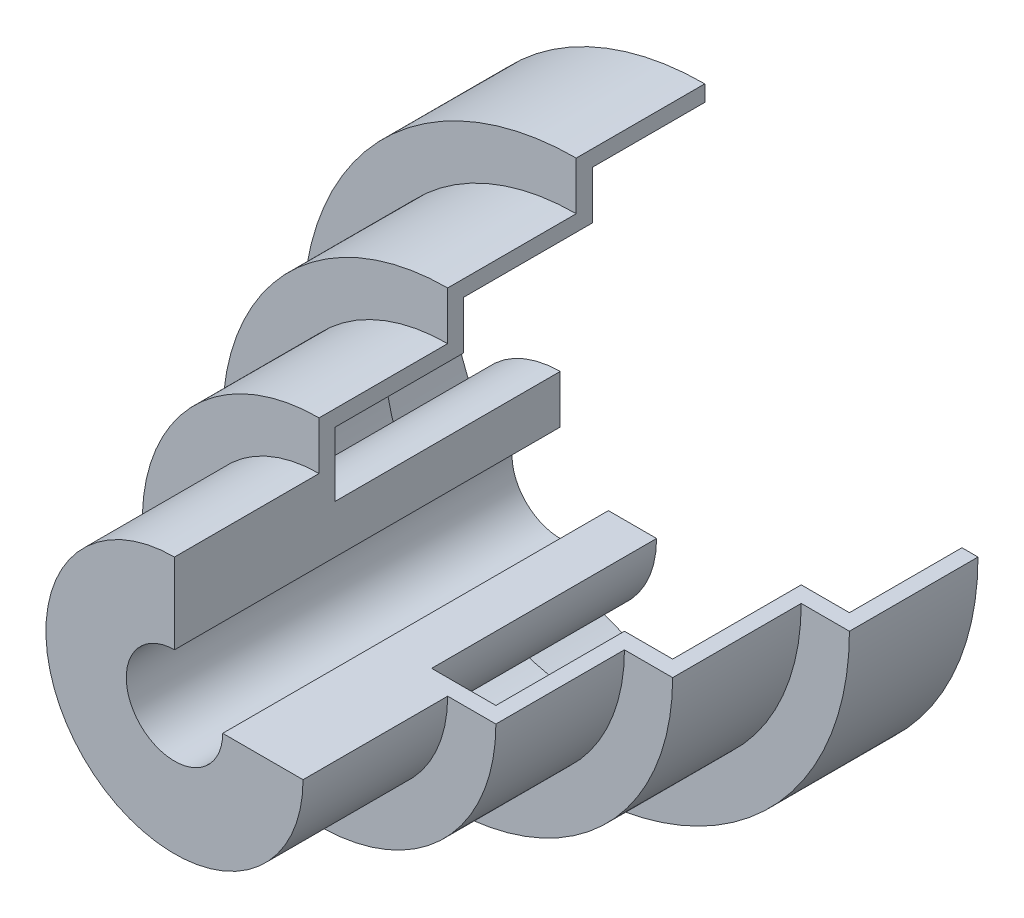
ISO-10303-21;
HEADER;
FILE_DESCRIPTION(('STEP AP214'),'2;1');
FILE_NAME('part.step','',(''),(''),'','','');
FILE_SCHEMA(('AUTOMOTIVE_DESIGN { 1 0 10303 214 1 1 1 1 }'));
ENDSEC;
DATA;
#1=APPLICATION_CONTEXT('core data for automotive mechanical design processes');
#2=APPLICATION_PROTOCOL_DEFINITION('international standard','automotive_design',2000,#1);
#3=PRODUCT_CONTEXT('',#1,'mechanical');
#4=PRODUCT('Part','Part','',(#3));
#5=PRODUCT_RELATED_PRODUCT_CATEGORY('part','',(#4));
#6=PRODUCT_DEFINITION_FORMATION('','',#4);
#7=PRODUCT_DEFINITION_CONTEXT('part definition',#1,'design');
#8=PRODUCT_DEFINITION('design','',#6,#7);
#9=PRODUCT_DEFINITION_SHAPE('','',#8);
#10=(LENGTH_UNIT() NAMED_UNIT(*) SI_UNIT(.MILLI.,.METRE.));
#11=(NAMED_UNIT(*) PLANE_ANGLE_UNIT() SI_UNIT($,.RADIAN.));
#12=(NAMED_UNIT(*) SI_UNIT($,.STERADIAN.) SOLID_ANGLE_UNIT());
#13=UNCERTAINTY_MEASURE_WITH_UNIT(LENGTH_MEASURE(1.E-05),#10,'distance_accuracy_value','');
#14=(GEOMETRIC_REPRESENTATION_CONTEXT(3) GLOBAL_UNCERTAINTY_ASSIGNED_CONTEXT((#13)) GLOBAL_UNIT_ASSIGNED_CONTEXT((#10,
#11,#12)) REPRESENTATION_CONTEXT('',''));
#15=CARTESIAN_POINT('',(0.,0.,0.));
#16=DIRECTION('',(0.,0.,1.));
#17=DIRECTION('',(1.,0.,0.));
#18=AXIS2_PLACEMENT_3D('',#15,#16,#17);
#19=CARTESIAN_POINT('',(40.,4.18977760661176E-13,120.));
#20=DIRECTION('',(0.,0.,1.));
#21=DIRECTION('',(1.,0.,0.));
#22=AXIS2_PLACEMENT_3D('',#19,#20,#21);
#23=PLANE('',#22);
#24=CARTESIAN_POINT('',(0.,0.,120.));
#25=DIRECTION('',(0.,0.,-1.));
#26=DIRECTION('',(-1.,0.,0.));
#27=AXIS2_PLACEMENT_3D('',#24,#25,#26);
#28=CIRCLE('',#27,15.);
#29=CARTESIAN_POINT('',(15.,1.57116660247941E-13,120.));
#30=VERTEX_POINT('',#29);
#31=CARTESIAN_POINT('',(0.,15.,120.));
#32=VERTEX_POINT('',#31);
#33=EDGE_CURVE('E11',#30,#32,#28,.T.);
#34=ORIENTED_EDGE('',*,*,#33,.T.);
#35=DIRECTION('',(0.,-1.,0.));
#36=VECTOR('',#35,1.);
#37=CARTESIAN_POINT('',(0.,40.,120.));
#38=LINE('',#37,#36);
#39=CARTESIAN_POINT('',(0.,40.,120.));
#40=VERTEX_POINT('',#39);
#41=EDGE_CURVE('E156',#40,#32,#38,.T.);
#42=ORIENTED_EDGE('',*,*,#41,.F.);
#43=CARTESIAN_POINT('',(0.,0.,120.));
#44=DIRECTION('',(0.,0.,-1.));
#45=DIRECTION('',(-1.,0.,0.));
#46=AXIS2_PLACEMENT_3D('',#43,#44,#45);
#47=CIRCLE('',#46,40.);
#48=CARTESIAN_POINT('',(40.,4.18977760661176E-13,120.));
#49=VERTEX_POINT('',#48);
#50=EDGE_CURVE('E47',#49,#40,#47,.T.);
#51=ORIENTED_EDGE('',*,*,#50,.F.);
#52=DIRECTION('',(-1.,0.,0.));
#53=VECTOR('',#52,1.);
#54=CARTESIAN_POINT('',(40.,4.18977760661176E-13,120.));
#55=LINE('',#54,#53);
#56=EDGE_CURVE('E158',#49,#30,#55,.T.);
#57=ORIENTED_EDGE('',*,*,#56,.T.);
#58=EDGE_LOOP('',(#34,#42,#51,#57));
#59=FACE_BOUND('',#58,.T.);
#60=ADVANCED_FACE('F32',(#59),#23,.T.);
#61=CARTESIAN_POINT('',(0.,0.,0.));
#62=DIRECTION('',(0.,0.,-1.));
#63=DIRECTION('',(-1.,0.,0.));
#64=AXIS2_PLACEMENT_3D('',#61,#62,#63);
#65=CYLINDRICAL_SURFACE('',#64,15.);
#66=CARTESIAN_POINT('',(0.,0.,0.));
#67=DIRECTION('',(0.,0.,-1.));
#68=DIRECTION('',(-1.,0.,0.));
#69=AXIS2_PLACEMENT_3D('',#66,#67,#68);
#70=CIRCLE('',#69,15.);
#71=CARTESIAN_POINT('',(15.,1.57116660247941E-13,0.));
#72=VERTEX_POINT('',#71);
#73=CARTESIAN_POINT('',(0.,15.,0.));
#74=VERTEX_POINT('',#73);
#75=EDGE_CURVE('E40',#72,#74,#70,.T.);
#76=ORIENTED_EDGE('',*,*,#75,.T.);
#77=DIRECTION('',(0.,0.,-1.));
#78=VECTOR('',#77,1.);
#79=CARTESIAN_POINT('',(0.,15.,120.));
#80=LINE('',#79,#78);
#81=EDGE_CURVE('E167',#32,#74,#80,.T.);
#82=ORIENTED_EDGE('',*,*,#81,.F.);
#83=ORIENTED_EDGE('',*,*,#33,.F.);
#84=DIRECTION('',(0.,0.,-1.));
#85=VECTOR('',#84,1.);
#86=CARTESIAN_POINT('',(15.,1.57116660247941E-13,120.));
#87=LINE('',#86,#85);
#88=EDGE_CURVE('E219',#30,#72,#87,.T.);
#89=ORIENTED_EDGE('',*,*,#88,.T.);
#90=EDGE_LOOP('',(#76,#82,#83,#89));
#91=FACE_BOUND('',#90,.T.);
#92=ADVANCED_FACE('F34',(#91),#65,.F.);
#93=CARTESIAN_POINT('',(15.,1.57116660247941E-13,0.));
#94=DIRECTION('',(0.,0.,-1.));
#95=DIRECTION('',(-1.,0.,0.));
#96=AXIS2_PLACEMENT_3D('',#93,#94,#95);
#97=PLANE('',#96);
#98=CARTESIAN_POINT('',(0.,0.,0.));
#99=DIRECTION('',(0.,0.,-1.));
#100=DIRECTION('',(-1.,0.,0.));
#101=AXIS2_PLACEMENT_3D('',#98,#99,#100);
#102=CIRCLE('',#101,30.);
#103=CARTESIAN_POINT('',(30.,3.14233320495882E-13,0.));
#104=VERTEX_POINT('',#103);
#105=CARTESIAN_POINT('',(0.,30.,0.));
#106=VERTEX_POINT('',#105);
#107=EDGE_CURVE('E295',#104,#106,#102,.T.);
#108=ORIENTED_EDGE('',*,*,#107,.T.);
#109=DIRECTION('',(0.,1.,0.));
#110=VECTOR('',#109,1.);
#111=CARTESIAN_POINT('',(0.,15.,0.));
#112=LINE('',#111,#110);
#113=EDGE_CURVE('E172',#74,#106,#112,.T.);
#114=ORIENTED_EDGE('',*,*,#113,.F.);
#115=ORIENTED_EDGE('',*,*,#75,.F.);
#116=DIRECTION('',(1.,0.,0.));
#117=VECTOR('',#116,1.);
#118=CARTESIAN_POINT('',(15.,1.57116660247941E-13,0.));
#119=LINE('',#118,#117);
#120=EDGE_CURVE('E221',#72,#104,#119,.T.);
#121=ORIENTED_EDGE('',*,*,#120,.T.);
#122=EDGE_LOOP('',(#108,#114,#115,#121));
#123=FACE_BOUND('',#122,.T.);
#124=ADVANCED_FACE('F297',(#123),#97,.T.);
#125=CARTESIAN_POINT('',(0.,0.,0.));
#126=DIRECTION('',(0.,0.,-1.));
#127=DIRECTION('',(-1.,0.,0.));
#128=AXIS2_PLACEMENT_3D('',#125,#126,#127);
#129=CYLINDRICAL_SURFACE('',#128,30.);
#130=CARTESIAN_POINT('',(0.,0.,70.));
#131=DIRECTION('',(0.,0.,-1.));
#132=DIRECTION('',(-1.,0.,0.));
#133=AXIS2_PLACEMENT_3D('',#130,#131,#132);
#134=CIRCLE('',#133,30.);
#135=CARTESIAN_POINT('',(30.,3.14233320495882E-13,70.));
#136=VERTEX_POINT('',#135);
#137=CARTESIAN_POINT('',(0.,30.,70.));
#138=VERTEX_POINT('',#137);
#139=EDGE_CURVE('E293',#136,#138,#134,.T.);
#140=ORIENTED_EDGE('',*,*,#139,.T.);
#141=DIRECTION('',(0.,0.,1.));
#142=VECTOR('',#141,1.);
#143=CARTESIAN_POINT('',(0.,30.,0.));
#144=LINE('',#143,#142);
#145=EDGE_CURVE('E174',#106,#138,#144,.T.);
#146=ORIENTED_EDGE('',*,*,#145,.F.);
#147=ORIENTED_EDGE('',*,*,#107,.F.);
#148=DIRECTION('',(0.,0.,1.));
#149=VECTOR('',#148,1.);
#150=CARTESIAN_POINT('',(30.,3.14233320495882E-13,0.));
#151=LINE('',#150,#149);
#152=EDGE_CURVE('E224',#104,#136,#151,.T.);
#153=ORIENTED_EDGE('',*,*,#152,.T.);
#154=EDGE_LOOP('',(#140,#146,#147,#153));
#155=FACE_BOUND('',#154,.T.);
#156=ADVANCED_FACE('F303',(#155),#129,.T.);
#157=CARTESIAN_POINT('',(30.,3.14233320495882E-13,70.));
#158=DIRECTION('',(0.,0.,-1.));
#159=DIRECTION('',(-1.,0.,0.));
#160=AXIS2_PLACEMENT_3D('',#157,#158,#159);
#161=PLANE('',#160);
#162=CARTESIAN_POINT('',(0.,0.,70.));
#163=DIRECTION('',(0.,0.,-1.));
#164=DIRECTION('',(-1.,0.,0.));
#165=AXIS2_PLACEMENT_3D('',#162,#163,#164);
#166=CIRCLE('',#165,50.);
#167=CARTESIAN_POINT('',(50.,5.2372220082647E-13,70.));
#168=VERTEX_POINT('',#167);
#169=CARTESIAN_POINT('',(0.,50.,70.));
#170=VERTEX_POINT('',#169);
#171=EDGE_CURVE('E291',#168,#170,#166,.T.);
#172=ORIENTED_EDGE('',*,*,#171,.T.);
#173=DIRECTION('',(0.,1.,0.));
#174=VECTOR('',#173,1.);
#175=CARTESIAN_POINT('',(0.,30.,70.));
#176=LINE('',#175,#174);
#177=EDGE_CURVE('E179',#138,#170,#176,.T.);
#178=ORIENTED_EDGE('',*,*,#177,.F.);
#179=ORIENTED_EDGE('',*,*,#139,.F.);
#180=DIRECTION('',(1.,0.,0.));
#181=VECTOR('',#180,1.);
#182=CARTESIAN_POINT('',(30.,3.14233320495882E-13,70.));
#183=LINE('',#182,#181);
#184=EDGE_CURVE('E227',#136,#168,#183,.T.);
#185=ORIENTED_EDGE('',*,*,#184,.T.);
#186=EDGE_LOOP('',(#172,#178,#179,#185));
#187=FACE_BOUND('',#186,.T.);
#188=ADVANCED_FACE('F306',(#187),#161,.T.);
#189=CARTESIAN_POINT('',(0.,0.,0.));
#190=DIRECTION('',(0.,0.,-1.));
#191=DIRECTION('',(-1.,0.,0.));
#192=AXIS2_PLACEMENT_3D('',#189,#190,#191);
#193=CYLINDRICAL_SURFACE('',#192,50.);
#194=CARTESIAN_POINT('',(0.,0.,30.));
#195=DIRECTION('',(0.,0.,-1.));
#196=DIRECTION('',(-1.,0.,0.));
#197=AXIS2_PLACEMENT_3D('',#194,#195,#196);
#198=CIRCLE('',#197,50.);
#199=CARTESIAN_POINT('',(50.,5.2372220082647E-13,30.));
#200=VERTEX_POINT('',#199);
#201=CARTESIAN_POINT('',(0.,50.,30.));
#202=VERTEX_POINT('',#201);
#203=EDGE_CURVE('E289',#200,#202,#198,.T.);
#204=ORIENTED_EDGE('',*,*,#203,.T.);
#205=DIRECTION('',(0.,0.,-1.));
#206=VECTOR('',#205,1.);
#207=CARTESIAN_POINT('',(0.,50.,70.));
#208=LINE('',#207,#206);
#209=EDGE_CURVE('E182',#170,#202,#208,.T.);
#210=ORIENTED_EDGE('',*,*,#209,.F.);
#211=ORIENTED_EDGE('',*,*,#171,.F.);
#212=DIRECTION('',(0.,0.,-1.));
#213=VECTOR('',#212,1.);
#214=CARTESIAN_POINT('',(50.,5.2372220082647E-13,70.));
#215=LINE('',#214,#213);
#216=EDGE_CURVE('E230',#168,#200,#215,.T.);
#217=ORIENTED_EDGE('',*,*,#216,.T.);
#218=EDGE_LOOP('',(#204,#210,#211,#217));
#219=FACE_BOUND('',#218,.T.);
#220=ADVANCED_FACE('F311',(#219),#193,.F.);
#221=CARTESIAN_POINT('',(50.,5.2372220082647E-13,30.));
#222=DIRECTION('',(0.,0.,-1.));
#223=DIRECTION('',(-1.,0.,0.));
#224=AXIS2_PLACEMENT_3D('',#221,#222,#223);
#225=PLANE('',#224);
#226=CARTESIAN_POINT('',(0.,0.,30.));
#227=DIRECTION('',(0.,0.,-1.));
#228=DIRECTION('',(-1.,0.,0.));
#229=AXIS2_PLACEMENT_3D('',#226,#227,#228);
#230=CIRCLE('',#229,65.);
#231=CARTESIAN_POINT('',(65.,6.80838861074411E-13,30.));
#232=VERTEX_POINT('',#231);
#233=CARTESIAN_POINT('',(0.,65.,30.));
#234=VERTEX_POINT('',#233);
#235=EDGE_CURVE('E287',#232,#234,#230,.T.);
#236=ORIENTED_EDGE('',*,*,#235,.T.);
#237=DIRECTION('',(0.,1.,0.));
#238=VECTOR('',#237,1.);
#239=CARTESIAN_POINT('',(0.,50.,30.));
#240=LINE('',#239,#238);
#241=EDGE_CURVE('E185',#202,#234,#240,.T.);
#242=ORIENTED_EDGE('',*,*,#241,.F.);
#243=ORIENTED_EDGE('',*,*,#203,.F.);
#244=DIRECTION('',(1.,0.,0.));
#245=VECTOR('',#244,1.);
#246=CARTESIAN_POINT('',(50.,5.2372220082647E-13,30.));
#247=LINE('',#246,#245);
#248=EDGE_CURVE('E233',#200,#232,#247,.T.);
#249=ORIENTED_EDGE('',*,*,#248,.T.);
#250=EDGE_LOOP('',(#236,#242,#243,#249));
#251=FACE_BOUND('',#250,.T.);
#252=ADVANCED_FACE('F314',(#251),#225,.T.);
#253=CARTESIAN_POINT('',(0.,0.,0.));
#254=DIRECTION('',(0.,0.,-1.));
#255=DIRECTION('',(-1.,0.,0.));
#256=AXIS2_PLACEMENT_3D('',#253,#254,#255);
#257=CYLINDRICAL_SURFACE('',#256,65.);
#258=CARTESIAN_POINT('',(0.,0.,-9.99999999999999));
#259=DIRECTION('',(0.,0.,-1.));
#260=DIRECTION('',(-1.,0.,0.));
#261=AXIS2_PLACEMENT_3D('',#258,#259,#260);
#262=CIRCLE('',#261,65.);
#263=CARTESIAN_POINT('',(65.,6.80838861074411E-13,-9.99999999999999));
#264=VERTEX_POINT('',#263);
#265=CARTESIAN_POINT('',(0.,65.,-9.99999999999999));
#266=VERTEX_POINT('',#265);
#267=EDGE_CURVE('E285',#264,#266,#262,.T.);
#268=ORIENTED_EDGE('',*,*,#267,.T.);
#269=DIRECTION('',(0.,0.,-1.));
#270=VECTOR('',#269,1.);
#271=CARTESIAN_POINT('',(0.,65.,30.));
#272=LINE('',#271,#270);
#273=EDGE_CURVE('E188',#234,#266,#272,.T.);
#274=ORIENTED_EDGE('',*,*,#273,.F.);
#275=ORIENTED_EDGE('',*,*,#235,.F.);
#276=DIRECTION('',(0.,0.,-1.));
#277=VECTOR('',#276,1.);
#278=CARTESIAN_POINT('',(65.,6.80838861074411E-13,30.));
#279=LINE('',#278,#277);
#280=EDGE_CURVE('E236',#232,#264,#279,.T.);
#281=ORIENTED_EDGE('',*,*,#280,.T.);
#282=EDGE_LOOP('',(#268,#274,#275,#281));
#283=FACE_BOUND('',#282,.T.);
#284=ADVANCED_FACE('F319',(#283),#257,.F.);
#285=CARTESIAN_POINT('',(65.,6.80838861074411E-13,-9.99999999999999));
#286=DIRECTION('',(0.,0.,-1.));
#287=DIRECTION('',(-1.,0.,0.));
#288=AXIS2_PLACEMENT_3D('',#285,#286,#287);
#289=PLANE('',#288);
#290=CARTESIAN_POINT('',(0.,0.,-9.99999999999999));
#291=DIRECTION('',(0.,0.,-1.));
#292=DIRECTION('',(-1.,0.,0.));
#293=AXIS2_PLACEMENT_3D('',#290,#291,#292);
#294=CIRCLE('',#293,80.);
#295=CARTESIAN_POINT('',(80.,8.37955521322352E-13,-9.99999999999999));
#296=VERTEX_POINT('',#295);
#297=CARTESIAN_POINT('',(0.,80.,-9.99999999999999));
#298=VERTEX_POINT('',#297);
#299=EDGE_CURVE('E283',#296,#298,#294,.T.);
#300=ORIENTED_EDGE('',*,*,#299,.T.);
#301=DIRECTION('',(0.,1.,0.));
#302=VECTOR('',#301,1.);
#303=CARTESIAN_POINT('',(0.,65.,-9.99999999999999));
#304=LINE('',#303,#302);
#305=EDGE_CURVE('E191',#266,#298,#304,.T.);
#306=ORIENTED_EDGE('',*,*,#305,.F.);
#307=ORIENTED_EDGE('',*,*,#267,.F.);
#308=DIRECTION('',(1.,0.,0.));
#309=VECTOR('',#308,1.);
#310=CARTESIAN_POINT('',(65.,6.80838861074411E-13,-9.99999999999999));
#311=LINE('',#310,#309);
#312=EDGE_CURVE('E239',#264,#296,#311,.T.);
#313=ORIENTED_EDGE('',*,*,#312,.T.);
#314=EDGE_LOOP('',(#300,#306,#307,#313));
#315=FACE_BOUND('',#314,.T.);
#316=ADVANCED_FACE('F322',(#315),#289,.T.);
#317=CARTESIAN_POINT('',(0.,0.,0.));
#318=DIRECTION('',(0.,0.,-1.));
#319=DIRECTION('',(-1.,0.,0.));
#320=AXIS2_PLACEMENT_3D('',#317,#318,#319);
#321=CYLINDRICAL_SURFACE('',#320,80.);
#322=CARTESIAN_POINT('',(0.,0.,-45.));
#323=DIRECTION('',(0.,0.,-1.));
#324=DIRECTION('',(-1.,0.,0.));
#325=AXIS2_PLACEMENT_3D('',#322,#323,#324);
#326=CIRCLE('',#325,80.);
#327=CARTESIAN_POINT('',(80.,8.37955521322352E-13,-45.));
#328=VERTEX_POINT('',#327);
#329=CARTESIAN_POINT('',(0.,80.,-45.));
#330=VERTEX_POINT('',#329);
#331=EDGE_CURVE('E281',#328,#330,#326,.T.);
#332=ORIENTED_EDGE('',*,*,#331,.T.);
#333=DIRECTION('',(0.,0.,-1.));
#334=VECTOR('',#333,1.);
#335=CARTESIAN_POINT('',(0.,80.,-9.99999999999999));
#336=LINE('',#335,#334);
#337=EDGE_CURVE('E194',#298,#330,#336,.T.);
#338=ORIENTED_EDGE('',*,*,#337,.F.);
#339=ORIENTED_EDGE('',*,*,#299,.F.);
#340=DIRECTION('',(0.,0.,-1.));
#341=VECTOR('',#340,1.);
#342=CARTESIAN_POINT('',(80.,8.37955521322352E-13,-9.99999999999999));
#343=LINE('',#342,#341);
#344=EDGE_CURVE('E242',#296,#328,#343,.T.);
#345=ORIENTED_EDGE('',*,*,#344,.T.);
#346=EDGE_LOOP('',(#332,#338,#339,#345));
#347=FACE_BOUND('',#346,.T.);
#348=ADVANCED_FACE('F327',(#347),#321,.F.);
#349=CARTESIAN_POINT('',(80.,8.37955521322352E-13,-45.));
#350=DIRECTION('',(0.,0.,-1.));
#351=DIRECTION('',(-1.,0.,0.));
#352=AXIS2_PLACEMENT_3D('',#349,#350,#351);
#353=PLANE('',#352);
#354=CARTESIAN_POINT('',(0.,0.,-45.));
#355=DIRECTION('',(0.,0.,-1.));
#356=DIRECTION('',(-1.,0.,0.));
#357=AXIS2_PLACEMENT_3D('',#354,#355,#356);
#358=CIRCLE('',#357,85.);
#359=CARTESIAN_POINT('',(85.,8.90327741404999E-13,-45.));
#360=VERTEX_POINT('',#359);
#361=CARTESIAN_POINT('',(0.,85.,-45.));
#362=VERTEX_POINT('',#361);
#363=EDGE_CURVE('E279',#360,#362,#358,.T.);
#364=ORIENTED_EDGE('',*,*,#363,.T.);
#365=DIRECTION('',(0.,1.,0.));
#366=VECTOR('',#365,1.);
#367=CARTESIAN_POINT('',(0.,80.,-45.));
#368=LINE('',#367,#366);
#369=EDGE_CURVE('E197',#330,#362,#368,.T.);
#370=ORIENTED_EDGE('',*,*,#369,.F.);
#371=ORIENTED_EDGE('',*,*,#331,.F.);
#372=DIRECTION('',(1.,0.,0.));
#373=VECTOR('',#372,1.);
#374=CARTESIAN_POINT('',(80.,8.37955521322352E-13,-45.));
#375=LINE('',#374,#373);
#376=EDGE_CURVE('E245',#328,#360,#375,.T.);
#377=ORIENTED_EDGE('',*,*,#376,.T.);
#378=EDGE_LOOP('',(#364,#370,#371,#377));
#379=FACE_BOUND('',#378,.T.);
#380=ADVANCED_FACE('F330',(#379),#353,.T.);
#381=CARTESIAN_POINT('',(0.,0.,0.));
#382=DIRECTION('',(0.,0.,-1.));
#383=DIRECTION('',(-1.,0.,0.));
#384=AXIS2_PLACEMENT_3D('',#381,#382,#383);
#385=CYLINDRICAL_SURFACE('',#384,85.);
#386=CARTESIAN_POINT('',(0.,0.,-5.));
#387=DIRECTION('',(0.,0.,-1.));
#388=DIRECTION('',(-1.,0.,0.));
#389=AXIS2_PLACEMENT_3D('',#386,#387,#388);
#390=CIRCLE('',#389,85.);
#391=CARTESIAN_POINT('',(85.,8.90327741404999E-13,-5.));
#392=VERTEX_POINT('',#391);
#393=CARTESIAN_POINT('',(0.,85.,-5.));
#394=VERTEX_POINT('',#393);
#395=EDGE_CURVE('E277',#392,#394,#390,.T.);
#396=ORIENTED_EDGE('',*,*,#395,.T.);
#397=DIRECTION('',(0.,0.,1.));
#398=VECTOR('',#397,1.);
#399=CARTESIAN_POINT('',(0.,85.,-45.));
#400=LINE('',#399,#398);
#401=EDGE_CURVE('E200',#362,#394,#400,.T.);
#402=ORIENTED_EDGE('',*,*,#401,.F.);
#403=ORIENTED_EDGE('',*,*,#363,.F.);
#404=DIRECTION('',(0.,0.,1.));
#405=VECTOR('',#404,1.);
#406=CARTESIAN_POINT('',(85.,8.90327741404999E-13,-45.));
#407=LINE('',#406,#405);
#408=EDGE_CURVE('E248',#360,#392,#407,.T.);
#409=ORIENTED_EDGE('',*,*,#408,.T.);
#410=EDGE_LOOP('',(#396,#402,#403,#409));
#411=FACE_BOUND('',#410,.T.);
#412=ADVANCED_FACE('F335',(#411),#385,.T.);
#413=CARTESIAN_POINT('',(85.,8.90327741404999E-13,-5.));
#414=DIRECTION('',(0.,0.,1.));
#415=DIRECTION('',(1.,0.,0.));
#416=AXIS2_PLACEMENT_3D('',#413,#414,#415);
#417=PLANE('',#416);
#418=CARTESIAN_POINT('',(0.,0.,-5.));
#419=DIRECTION('',(0.,0.,-1.));
#420=DIRECTION('',(-1.,0.,0.));
#421=AXIS2_PLACEMENT_3D('',#418,#419,#420);
#422=CIRCLE('',#421,70.);
#423=CARTESIAN_POINT('',(70.,7.33211081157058E-13,-5.));
#424=VERTEX_POINT('',#423);
#425=CARTESIAN_POINT('',(0.,70.,-5.));
#426=VERTEX_POINT('',#425);
#427=EDGE_CURVE('E275',#424,#426,#422,.T.);
#428=ORIENTED_EDGE('',*,*,#427,.T.);
#429=DIRECTION('',(0.,-1.,0.));
#430=VECTOR('',#429,1.);
#431=CARTESIAN_POINT('',(0.,85.,-5.));
#432=LINE('',#431,#430);
#433=EDGE_CURVE('E203',#394,#426,#432,.T.);
#434=ORIENTED_EDGE('',*,*,#433,.F.);
#435=ORIENTED_EDGE('',*,*,#395,.F.);
#436=DIRECTION('',(-1.,0.,0.));
#437=VECTOR('',#436,1.);
#438=CARTESIAN_POINT('',(85.,8.90327741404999E-13,-5.));
#439=LINE('',#438,#437);
#440=EDGE_CURVE('E251',#392,#424,#439,.T.);
#441=ORIENTED_EDGE('',*,*,#440,.T.);
#442=EDGE_LOOP('',(#428,#434,#435,#441));
#443=FACE_BOUND('',#442,.T.);
#444=ADVANCED_FACE('F338',(#443),#417,.T.);
#445=CARTESIAN_POINT('',(0.,0.,0.));
#446=DIRECTION('',(0.,0.,-1.));
#447=DIRECTION('',(-1.,0.,0.));
#448=AXIS2_PLACEMENT_3D('',#445,#446,#447);
#449=CYLINDRICAL_SURFACE('',#448,70.);
#450=CARTESIAN_POINT('',(0.,0.,35.));
#451=DIRECTION('',(0.,0.,-1.));
#452=DIRECTION('',(-1.,0.,0.));
#453=AXIS2_PLACEMENT_3D('',#450,#451,#452);
#454=CIRCLE('',#453,70.);
#455=CARTESIAN_POINT('',(70.,7.33211081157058E-13,35.));
#456=VERTEX_POINT('',#455);
#457=CARTESIAN_POINT('',(0.,70.,35.));
#458=VERTEX_POINT('',#457);
#459=EDGE_CURVE('E273',#456,#458,#454,.T.);
#460=ORIENTED_EDGE('',*,*,#459,.T.);
#461=DIRECTION('',(0.,0.,1.));
#462=VECTOR('',#461,1.);
#463=CARTESIAN_POINT('',(0.,70.,-5.));
#464=LINE('',#463,#462);
#465=EDGE_CURVE('E206',#426,#458,#464,.T.);
#466=ORIENTED_EDGE('',*,*,#465,.F.);
#467=ORIENTED_EDGE('',*,*,#427,.F.);
#468=DIRECTION('',(0.,0.,1.));
#469=VECTOR('',#468,1.);
#470=CARTESIAN_POINT('',(70.,7.33211081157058E-13,-5.));
#471=LINE('',#470,#469);
#472=EDGE_CURVE('E254',#424,#456,#471,.T.);
#473=ORIENTED_EDGE('',*,*,#472,.T.);
#474=EDGE_LOOP('',(#460,#466,#467,#473));
#475=FACE_BOUND('',#474,.T.);
#476=ADVANCED_FACE('F343',(#475),#449,.T.);
#477=CARTESIAN_POINT('',(70.,7.33211081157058E-13,35.));
#478=DIRECTION('',(0.,0.,1.));
#479=DIRECTION('',(1.,0.,0.));
#480=AXIS2_PLACEMENT_3D('',#477,#478,#479);
#481=PLANE('',#480);
#482=CARTESIAN_POINT('',(0.,0.,35.));
#483=DIRECTION('',(0.,0.,-1.));
#484=DIRECTION('',(-1.,0.,0.));
#485=AXIS2_PLACEMENT_3D('',#482,#483,#484);
#486=CIRCLE('',#485,55.);
#487=CARTESIAN_POINT('',(55.,5.76094420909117E-13,35.));
#488=VERTEX_POINT('',#487);
#489=CARTESIAN_POINT('',(0.,55.,35.));
#490=VERTEX_POINT('',#489);
#491=EDGE_CURVE('E271',#488,#490,#486,.T.);
#492=ORIENTED_EDGE('',*,*,#491,.T.);
#493=DIRECTION('',(0.,-1.,0.));
#494=VECTOR('',#493,1.);
#495=CARTESIAN_POINT('',(0.,70.,35.));
#496=LINE('',#495,#494);
#497=EDGE_CURVE('E209',#458,#490,#496,.T.);
#498=ORIENTED_EDGE('',*,*,#497,.F.);
#499=ORIENTED_EDGE('',*,*,#459,.F.);
#500=DIRECTION('',(-1.,0.,0.));
#501=VECTOR('',#500,1.);
#502=CARTESIAN_POINT('',(70.,7.33211081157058E-13,35.));
#503=LINE('',#502,#501);
#504=EDGE_CURVE('E257',#456,#488,#503,.T.);
#505=ORIENTED_EDGE('',*,*,#504,.T.);
#506=EDGE_LOOP('',(#492,#498,#499,#505));
#507=FACE_BOUND('',#506,.T.);
#508=ADVANCED_FACE('F346',(#507),#481,.T.);
#509=CARTESIAN_POINT('',(0.,0.,0.));
#510=DIRECTION('',(0.,0.,-1.));
#511=DIRECTION('',(-1.,0.,0.));
#512=AXIS2_PLACEMENT_3D('',#509,#510,#511);
#513=CYLINDRICAL_SURFACE('',#512,55.);
#514=CARTESIAN_POINT('',(0.,0.,75.));
#515=DIRECTION('',(0.,0.,-1.));
#516=DIRECTION('',(-1.,0.,0.));
#517=AXIS2_PLACEMENT_3D('',#514,#515,#516);
#518=CIRCLE('',#517,55.);
#519=CARTESIAN_POINT('',(55.,5.76094420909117E-13,75.));
#520=VERTEX_POINT('',#519);
#521=CARTESIAN_POINT('',(0.,55.,75.));
#522=VERTEX_POINT('',#521);
#523=EDGE_CURVE('E269',#520,#522,#518,.T.);
#524=ORIENTED_EDGE('',*,*,#523,.T.);
#525=DIRECTION('',(0.,0.,1.));
#526=VECTOR('',#525,1.);
#527=CARTESIAN_POINT('',(0.,55.,35.));
#528=LINE('',#527,#526);
#529=EDGE_CURVE('E212',#490,#522,#528,.T.);
#530=ORIENTED_EDGE('',*,*,#529,.F.);
#531=ORIENTED_EDGE('',*,*,#491,.F.);
#532=DIRECTION('',(0.,0.,1.));
#533=VECTOR('',#532,1.);
#534=CARTESIAN_POINT('',(55.,5.76094420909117E-13,35.));
#535=LINE('',#534,#533);
#536=EDGE_CURVE('E260',#488,#520,#535,.T.);
#537=ORIENTED_EDGE('',*,*,#536,.T.);
#538=EDGE_LOOP('',(#524,#530,#531,#537));
#539=FACE_BOUND('',#538,.T.);
#540=ADVANCED_FACE('F351',(#539),#513,.T.);
#541=CARTESIAN_POINT('',(55.,5.76094420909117E-13,75.));
#542=DIRECTION('',(0.,0.,1.));
#543=DIRECTION('',(1.,0.,0.));
#544=AXIS2_PLACEMENT_3D('',#541,#542,#543);
#545=PLANE('',#544);
#546=CARTESIAN_POINT('',(0.,0.,75.));
#547=DIRECTION('',(0.,0.,-1.));
#548=DIRECTION('',(-1.,0.,0.));
#549=AXIS2_PLACEMENT_3D('',#546,#547,#548);
#550=CIRCLE('',#549,40.);
#551=CARTESIAN_POINT('',(40.,4.18977760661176E-13,75.));
#552=VERTEX_POINT('',#551);
#553=CARTESIAN_POINT('',(0.,40.,75.));
#554=VERTEX_POINT('',#553);
#555=EDGE_CURVE('E55',#552,#554,#550,.T.);
#556=ORIENTED_EDGE('',*,*,#555,.T.);
#557=DIRECTION('',(0.,-1.,0.));
#558=VECTOR('',#557,1.);
#559=CARTESIAN_POINT('',(0.,55.,75.));
#560=LINE('',#559,#558);
#561=EDGE_CURVE('E215',#522,#554,#560,.T.);
#562=ORIENTED_EDGE('',*,*,#561,.F.);
#563=ORIENTED_EDGE('',*,*,#523,.F.);
#564=DIRECTION('',(-1.,0.,0.));
#565=VECTOR('',#564,1.);
#566=CARTESIAN_POINT('',(55.,5.76094420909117E-13,75.));
#567=LINE('',#566,#565);
#568=EDGE_CURVE('E263',#520,#552,#567,.T.);
#569=ORIENTED_EDGE('',*,*,#568,.T.);
#570=EDGE_LOOP('',(#556,#562,#563,#569));
#571=FACE_BOUND('',#570,.T.);
#572=ADVANCED_FACE('F354',(#571),#545,.T.);
#573=CARTESIAN_POINT('',(0.,0.,0.));
#574=DIRECTION('',(0.,0.,-1.));
#575=DIRECTION('',(-1.,0.,0.));
#576=AXIS2_PLACEMENT_3D('',#573,#574,#575);
#577=CYLINDRICAL_SURFACE('',#576,40.);
#578=DIRECTION('',(0.,0.,1.));
#579=VECTOR('',#578,1.);
#580=CARTESIAN_POINT('',(40.,4.18977760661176E-13,75.));
#581=LINE('',#580,#579);
#582=EDGE_CURVE('E265',#552,#49,#581,.T.);
#583=ORIENTED_EDGE('',*,*,#582,.T.);
#584=ORIENTED_EDGE('',*,*,#50,.T.);
#585=DIRECTION('',(0.,0.,1.));
#586=VECTOR('',#585,1.);
#587=CARTESIAN_POINT('',(0.,40.,75.));
#588=LINE('',#587,#586);
#589=EDGE_CURVE('E170',#554,#40,#588,.T.);
#590=ORIENTED_EDGE('',*,*,#589,.F.);
#591=ORIENTED_EDGE('',*,*,#555,.F.);
#592=EDGE_LOOP('',(#583,#584,#590,#591));
#593=FACE_BOUND('',#592,.T.);
#594=ADVANCED_FACE('F356',(#593),#577,.T.);
#595=CARTESIAN_POINT('',(0.,0.,0.));
#596=DIRECTION('',(0.,-1.,0.));
#597=DIRECTION('',(0.,0.,-1.));
#598=AXIS2_PLACEMENT_3D('',#595,#596,#597);
#599=PLANE('',#598);
#600=ORIENTED_EDGE('',*,*,#56,.F.);
#601=ORIENTED_EDGE('',*,*,#582,.F.);
#602=ORIENTED_EDGE('',*,*,#568,.F.);
#603=ORIENTED_EDGE('',*,*,#536,.F.);
#604=ORIENTED_EDGE('',*,*,#504,.F.);
#605=ORIENTED_EDGE('',*,*,#472,.F.);
#606=ORIENTED_EDGE('',*,*,#440,.F.);
#607=ORIENTED_EDGE('',*,*,#408,.F.);
#608=ORIENTED_EDGE('',*,*,#376,.F.);
#609=ORIENTED_EDGE('',*,*,#344,.F.);
#610=ORIENTED_EDGE('',*,*,#312,.F.);
#611=ORIENTED_EDGE('',*,*,#280,.F.);
#612=ORIENTED_EDGE('',*,*,#248,.F.);
#613=ORIENTED_EDGE('',*,*,#216,.F.);
#614=ORIENTED_EDGE('',*,*,#184,.F.);
#615=ORIENTED_EDGE('',*,*,#152,.F.);
#616=ORIENTED_EDGE('',*,*,#120,.F.);
#617=ORIENTED_EDGE('',*,*,#88,.F.);
#618=EDGE_LOOP('',(#600,#601,#602,#603,#604,#605,#606,#607,#608,#609,#610,#611,#612,#613,#614,
#615,#616,#617));
#619=FACE_BOUND('',#618,.T.);
#620=ADVANCED_FACE('F358',(#619),#599,.F.);
#621=CARTESIAN_POINT('',(0.,0.,0.));
#622=DIRECTION('',(1.,0.,0.));
#623=DIRECTION('',(0.,0.,-1.));
#624=AXIS2_PLACEMENT_3D('',#621,#622,#623);
#625=PLANE('',#624);
#626=ORIENTED_EDGE('',*,*,#41,.T.);
#627=ORIENTED_EDGE('',*,*,#81,.T.);
#628=ORIENTED_EDGE('',*,*,#113,.T.);
#629=ORIENTED_EDGE('',*,*,#145,.T.);
#630=ORIENTED_EDGE('',*,*,#177,.T.);
#631=ORIENTED_EDGE('',*,*,#209,.T.);
#632=ORIENTED_EDGE('',*,*,#241,.T.);
#633=ORIENTED_EDGE('',*,*,#273,.T.);
#634=ORIENTED_EDGE('',*,*,#305,.T.);
#635=ORIENTED_EDGE('',*,*,#337,.T.);
#636=ORIENTED_EDGE('',*,*,#369,.T.);
#637=ORIENTED_EDGE('',*,*,#401,.T.);
#638=ORIENTED_EDGE('',*,*,#433,.T.);
#639=ORIENTED_EDGE('',*,*,#465,.T.);
#640=ORIENTED_EDGE('',*,*,#497,.T.);
#641=ORIENTED_EDGE('',*,*,#529,.T.);
#642=ORIENTED_EDGE('',*,*,#561,.T.);
#643=ORIENTED_EDGE('',*,*,#589,.T.);
#644=EDGE_LOOP('',(#626,#627,#628,#629,#630,#631,#632,#633,#634,#635,#636,#637,#638,#639,#640,
#641,#642,#643));
#645=FACE_BOUND('',#644,.T.);
#646=ADVANCED_FACE('F165',(#645),#625,.T.);
#647=CLOSED_SHELL('',(#60,#92,#124,#156,#188,#220,#252,#284,#316,#348,#380,#412,#444,#476,#508,
#540,#572,#594,#620,#646));
#648=MANIFOLD_SOLID_BREP('B2',#647);
#649=ADVANCED_BREP_SHAPE_REPRESENTATION('',(#18,#648),#14);
#650=SHAPE_DEFINITION_REPRESENTATION(#9,#649);
ENDSEC;
END-ISO-10303-21;
